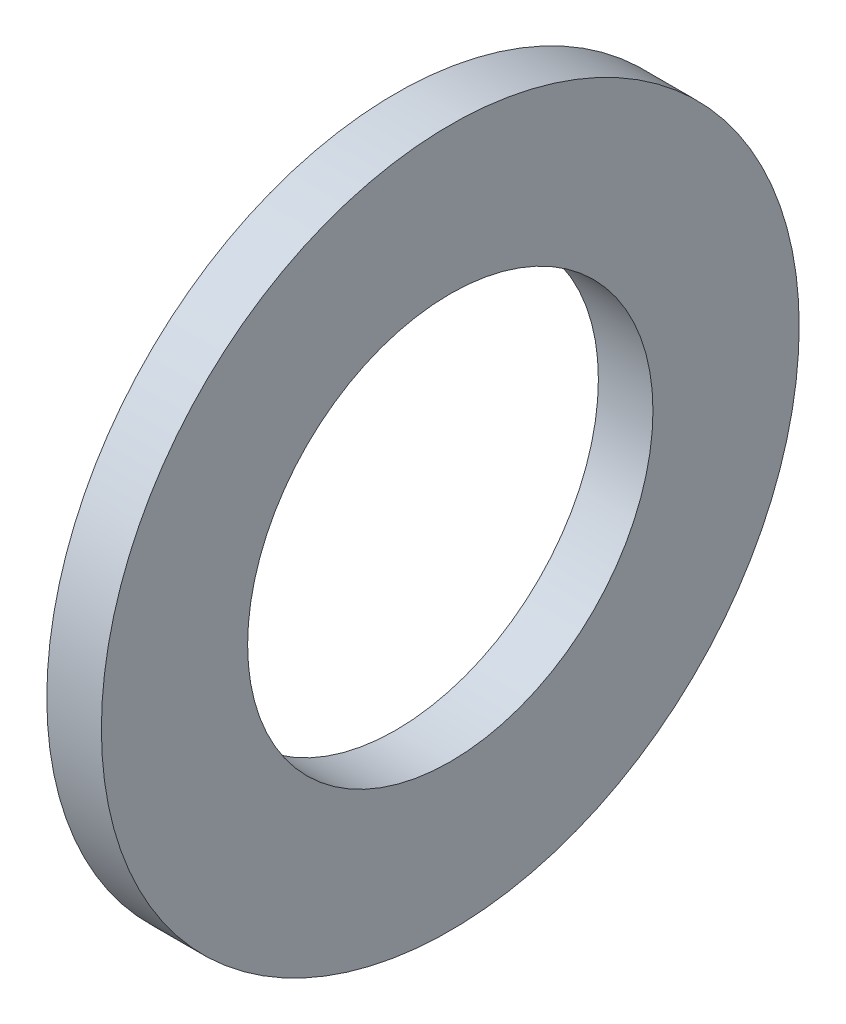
from build123d import *

# Parameters (mm, degrees)
SKETCH1_R           = 16.7259
SKETCH1_R_2         = 9.7155
BOSS_EXTRUDE1_DEPTH = 2.6162


with BuildPart() as part:
    # Sketch1 → Boss-Extrude1 (new body)
    with BuildSketch(Plane(origin=(0, 0, 0), x_dir=(0, 0, -1), z_dir=(1, 0, 0))):
        Circle(SKETCH1_R)
        Circle(SKETCH1_R_2, mode=Mode.SUBTRACT)
    extrude(amount=BOSS_EXTRUDE1_DEPTH)


solid = part.part
